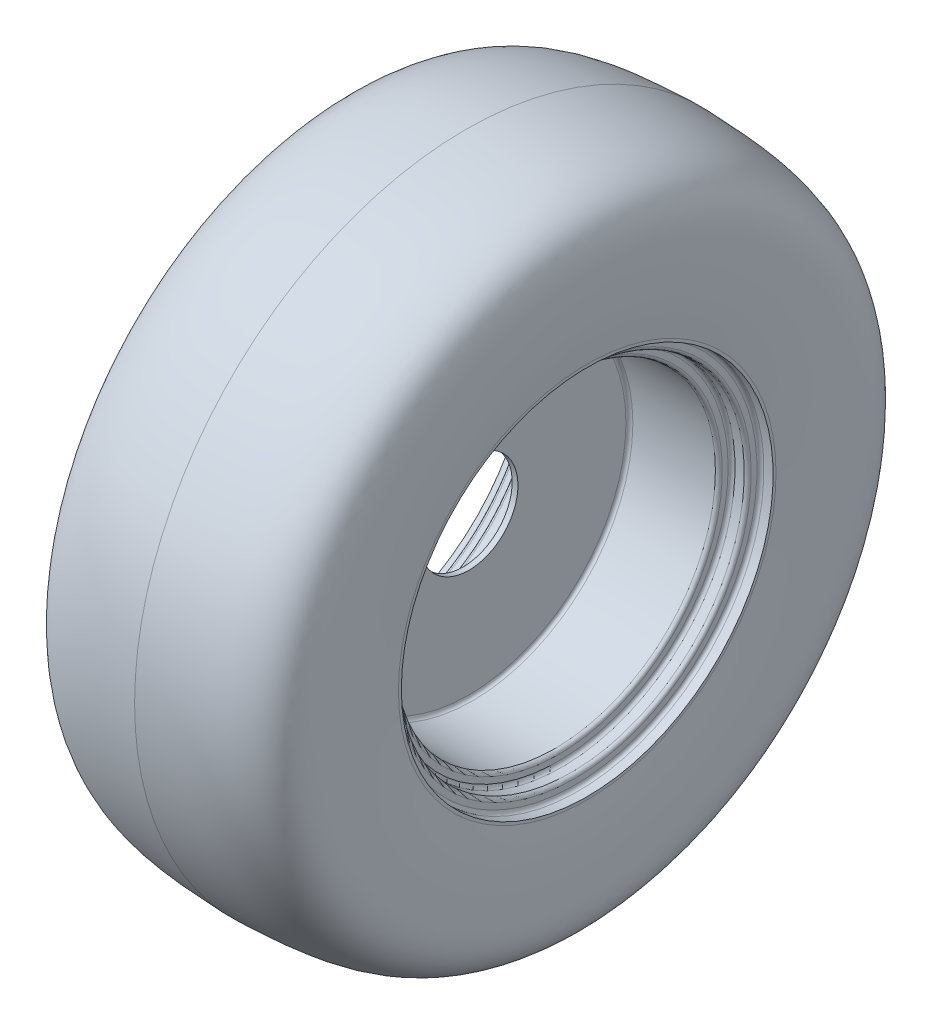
from build123d import *


with BuildPart() as part:
    # Esquisse1 → R_volution1 (revolve)
    with BuildSketch(Plane(origin=(0, 0, 0), x_dir=(1, 0, 0), z_dir=(0, 1, 0)), mode=Mode.PRIVATE) as r_volution1_sk:
        with BuildLine():
            Line((-105, 163.5), (-105, 161))
            Line((-105, 161), (-97, 161))
            ThreePointArc((-97, 161), (-94.878679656, 160.121320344), (-94, 158))
            Line((-94, 158), (-94, 153))
            ThreePointArc((-94, 153), (-93.121320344, 150.878679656), (-91, 150))
            Line((-91, 150), (-83, 150))
            ThreePointArc((-83, 150), (-80.878679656, 149.121320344), (-80, 147))
            Line((-80, 147), (-80, 142))
            ThreePointArc((-80, 142), (-79.121320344, 139.878679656), (-77, 139))
            Line((-77, 139), (-5.5, 139))
            ThreePointArc((-5.5, 139), (-3.378679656, 138.121320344), (-2.5, 136))
            Line((-2.5, 136), (-2.5, 42.5))
            Line((-2.5, 42.5), (2.5, 42.5))
            Line((2.5, 42.5), (2.5, 136))
            ThreePointArc((2.5, 136), (3.378679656, 138.121320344), (5.5, 139))
            Line((5.5, 139), (77, 139))
            ThreePointArc((77, 139), (79.121320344, 139.878679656), (80, 142))
            Line((80, 142), (80, 147))
            ThreePointArc((80, 147), (80.878679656, 149.121320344), (83, 150))
            Line((83, 150), (91, 150))
            ThreePointArc((91, 150), (93.121320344, 150.878679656), (94, 153))
            Line((94, 153), (94, 158))
            ThreePointArc((94, 158), (94.878679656, 160.121320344), (97, 161))
            Line((97, 161), (105, 161))
            Line((105, 161), (105, 163.5))
            add(Edge.make_bspline(
                [(0, 287), (48.8582228, 285.221180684), (109.617233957, 283.00908011), (107.400956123, 220.381127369), (107.459659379, 192.047635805), (105.739330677, 172.080921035), (105, 163.5)],
                knots=[0, 0, 0, 0, 0.56280124, 0.699887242, 0.871023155, 1, 1, 1, 1], degree=3))
            add(Edge.make_bspline(
                [(0, 287), (-48.8582228, 285.221180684), (-109.617233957, 283.00908011), (-107.400956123, 220.381127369), (-107.459659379, 192.047635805), (-105.739330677, 172.080921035), (-105, 163.5)],
                knots=[0, 0, 0, 0, 0.56280124, 0.699887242, 0.871023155, 1, 1, 1, 1], degree=3))
        make_face()
    revolve(r_volution1_sk.sketch.rotate(Axis((-61.186972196, 0, 0), (1, 0, 0)), 180), axis=Axis((-61.186972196, 0, 0), (1, 0, 0)))


solid = part.part
